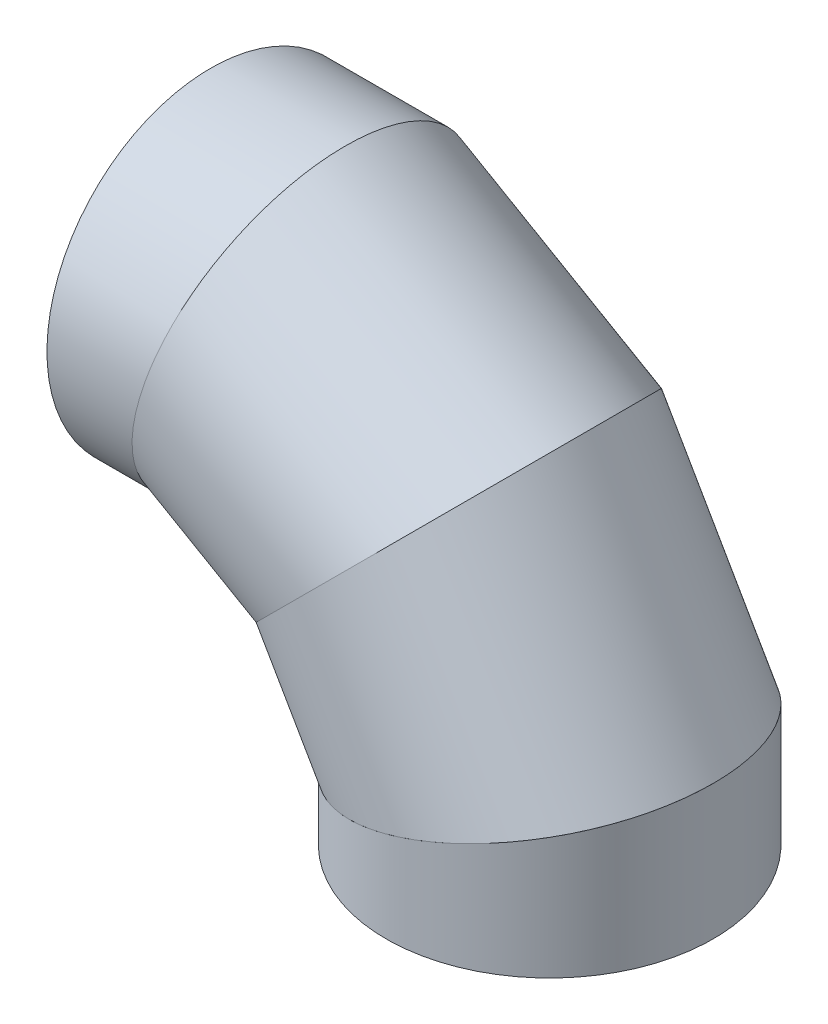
ISO-10303-21;
HEADER;
FILE_DESCRIPTION(('STEP AP214'),'2;1');
FILE_NAME('part.step','',(''),(''),'','','');
FILE_SCHEMA(('AUTOMOTIVE_DESIGN { 1 0 10303 214 1 1 1 1 }'));
ENDSEC;
DATA;
#1=APPLICATION_CONTEXT('core data for automotive mechanical design processes');
#2=APPLICATION_PROTOCOL_DEFINITION('international standard','automotive_design',2000,#1);
#3=PRODUCT_CONTEXT('',#1,'mechanical');
#4=PRODUCT('Part','Part','',(#3));
#5=PRODUCT_RELATED_PRODUCT_CATEGORY('part','',(#4));
#6=PRODUCT_DEFINITION_FORMATION('','',#4);
#7=PRODUCT_DEFINITION_CONTEXT('part definition',#1,'design');
#8=PRODUCT_DEFINITION('design','',#6,#7);
#9=PRODUCT_DEFINITION_SHAPE('','',#8);
#10=(LENGTH_UNIT() NAMED_UNIT(*) SI_UNIT(.MILLI.,.METRE.));
#11=(NAMED_UNIT(*) PLANE_ANGLE_UNIT() SI_UNIT($,.RADIAN.));
#12=(NAMED_UNIT(*) SI_UNIT($,.STERADIAN.) SOLID_ANGLE_UNIT());
#13=UNCERTAINTY_MEASURE_WITH_UNIT(LENGTH_MEASURE(1.E-05),#10,'distance_accuracy_value','');
#14=(GEOMETRIC_REPRESENTATION_CONTEXT(3) GLOBAL_UNCERTAINTY_ASSIGNED_CONTEXT((#13)) GLOBAL_UNIT_ASSIGNED_CONTEXT((#10,
#11,#12)) REPRESENTATION_CONTEXT('',''));
#15=CARTESIAN_POINT('',(0.,0.,0.));
#16=DIRECTION('',(0.,0.,1.));
#17=DIRECTION('',(1.,0.,0.));
#18=AXIS2_PLACEMENT_3D('',#15,#16,#17);
#19=CARTESIAN_POINT('',(132.61598246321,904.929584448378,0.));
#20=DIRECTION('',(0.866025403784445,-0.499999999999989,0.));
#21=DIRECTION('',(0.499999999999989,0.866025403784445,0.));
#22=AXIS2_PLACEMENT_3D('',#19,#20,#21);
#23=CYLINDRICAL_SURFACE('',#22,410.);
#24=CARTESIAN_POINT('',(227.756813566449,850.,0.));
#25=DIRECTION('',(-0.96592582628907,0.258819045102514,0.));
#26=DIRECTION('',(-0.258819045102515,-0.96592582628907,0.));
#27=AXIS2_PLACEMENT_3D('',#24,#25,#26);
#28=ELLIPSE('',#27,424.463233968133,410.);
#29=CARTESIAN_POINT('',(117.897726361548,440.000304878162,0.5));
#30=VERTEX_POINT('',#29);
#31=CARTESIAN_POINT('',(117.897726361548,440.000304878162,-0.5));
#32=VERTEX_POINT('',#31);
#33=EDGE_CURVE('E91',#30,#32,#28,.T.);
#34=ORIENTED_EDGE('',*,*,#33,.F.);
#35=DIRECTION('',(0.866025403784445,-0.499999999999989,0.));
#36=VECTOR('',#35,1.);
#37=CARTESIAN_POINT('',(-72.3838650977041,549.859432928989,0.5));
#38=LINE('',#37,#36);
#39=CARTESIAN_POINT('',(322.102578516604,322.102578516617,0.5));
#40=VERTEX_POINT('',#39);
#41=EDGE_CURVE('E105',#30,#40,#38,.T.);
#42=ORIENTED_EDGE('',*,*,#41,.T.);
#43=CARTESIAN_POINT('',(622.243186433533,622.243186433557,0.));
#44=DIRECTION('',(0.707106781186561,-0.707106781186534,0.));
#45=DIRECTION('',(0.707106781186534,0.707106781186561,0.));
#46=AXIS2_PLACEMENT_3D('',#43,#44,#45);
#47=ELLIPSE('',#46,424.463233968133,410.);
#48=CARTESIAN_POINT('',(322.102578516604,322.102578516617,-0.5));
#49=VERTEX_POINT('',#48);
#50=EDGE_CURVE('E100',#49,#40,#47,.T.);
#51=ORIENTED_EDGE('',*,*,#50,.F.);
#52=DIRECTION('',(0.866025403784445,-0.499999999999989,0.));
#53=VECTOR('',#52,1.);
#54=CARTESIAN_POINT('',(-72.3838650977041,549.859432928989,-0.5));
#55=LINE('',#54,#53);
#56=EDGE_CURVE('E114',#32,#49,#55,.T.);
#57=ORIENTED_EDGE('',*,*,#56,.F.);
#58=EDGE_LOOP('',(#34,#42,#51,#57));
#59=FACE_BOUND('',#58,.T.);
#60=ADVANCED_FACE('F47',(#59),#23,.T.);
#61=CARTESIAN_POINT('',(0.,0.,-410.));
#62=DIRECTION('',(0.707106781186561,-0.707106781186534,0.));
#63=DIRECTION('',(0.707106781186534,0.707106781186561,0.));
#64=AXIS2_PLACEMENT_3D('',#61,#62,#63);
#65=PLANE('',#64);
#66=DIRECTION('',(-0.707106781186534,-0.707106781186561,0.));
#67=VECTOR('',#66,1.);
#68=CARTESIAN_POINT('',(0.,0.,0.5));
#69=LINE('',#68,#67);
#70=CARTESIAN_POINT('',(322.834629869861,322.834629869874,0.5));
#71=VERTEX_POINT('',#70);
#72=EDGE_CURVE('E111',#71,#40,#69,.T.);
#73=ORIENTED_EDGE('',*,*,#72,.F.);
#74=CARTESIAN_POINT('',(622.243186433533,622.243186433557,0.));
#75=DIRECTION('',(0.707106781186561,-0.707106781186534,0.));
#76=DIRECTION('',(0.707106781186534,0.707106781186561,0.));
#77=AXIS2_PLACEMENT_3D('',#74,#75,#76);
#78=ELLIPSE('',#77,423.427957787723,409.);
#79=CARTESIAN_POINT('',(322.834629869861,322.834629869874,-0.5));
#80=VERTEX_POINT('',#79);
#81=EDGE_CURVE('E101',#80,#71,#78,.T.);
#82=ORIENTED_EDGE('',*,*,#81,.F.);
#83=DIRECTION('',(-0.707106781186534,-0.707106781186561,0.));
#84=VECTOR('',#83,1.);
#85=CARTESIAN_POINT('',(0.,0.,-0.5));
#86=LINE('',#85,#84);
#87=EDGE_CURVE('E68',#80,#49,#86,.T.);
#88=ORIENTED_EDGE('',*,*,#87,.T.);
#89=ORIENTED_EDGE('',*,*,#50,.T.);
#90=EDGE_LOOP('',(#73,#82,#88,#89));
#91=FACE_BOUND('',#90,.T.);
#92=ADVANCED_FACE('F119',(#91),#65,.T.);
#93=CARTESIAN_POINT('',(337.615982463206,1260.,-410.));
#94=DIRECTION('',(-0.96592582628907,0.258819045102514,0.));
#95=DIRECTION('',(-0.258819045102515,-0.96592582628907,0.));
#96=AXIS2_PLACEMENT_3D('',#93,#94,#95);
#97=PLANE('',#96);
#98=DIRECTION('',(0.258819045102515,0.96592582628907,0.));
#99=VECTOR('',#98,1.);
#100=CARTESIAN_POINT('',(337.615982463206,1260.,0.5));
#101=LINE('',#100,#99);
#102=CARTESIAN_POINT('',(118.165675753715,441.000305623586,0.5));
#103=VERTEX_POINT('',#102);
#104=EDGE_CURVE('E60',#30,#103,#101,.T.);
#105=ORIENTED_EDGE('',*,*,#104,.F.);
#106=ORIENTED_EDGE('',*,*,#33,.T.);
#107=DIRECTION('',(0.258819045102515,0.96592582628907,0.));
#108=VECTOR('',#107,1.);
#109=CARTESIAN_POINT('',(337.615982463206,1260.,-0.5));
#110=LINE('',#109,#108);
#111=CARTESIAN_POINT('',(118.165675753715,441.000305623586,-0.5));
#112=VERTEX_POINT('',#111);
#113=EDGE_CURVE('E85',#32,#112,#110,.T.);
#114=ORIENTED_EDGE('',*,*,#113,.T.);
#115=CARTESIAN_POINT('',(227.756813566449,850.,0.));
#116=DIRECTION('',(-0.96592582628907,0.258819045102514,0.));
#117=DIRECTION('',(-0.258819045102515,-0.96592582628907,0.));
#118=AXIS2_PLACEMENT_3D('',#115,#116,#117);
#119=ELLIPSE('',#118,423.427957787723,409.);
#120=EDGE_CURVE('E96',#103,#112,#119,.T.);
#121=ORIENTED_EDGE('',*,*,#120,.F.);
#122=EDGE_LOOP('',(#105,#106,#114,#121));
#123=FACE_BOUND('',#122,.T.);
#124=ADVANCED_FACE('F95',(#123),#97,.T.);
#125=CARTESIAN_POINT('',(132.61598246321,904.929584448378,0.));
#126=DIRECTION('',(0.866025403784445,-0.499999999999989,0.));
#127=DIRECTION('',(0.499999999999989,0.866025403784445,0.));
#128=AXIS2_PLACEMENT_3D('',#125,#126,#127);
#129=CYLINDRICAL_SURFACE('',#128,409.);
#130=DIRECTION('',(0.866025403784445,-0.499999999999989,0.));
#131=VECTOR('',#130,1.);
#132=CARTESIAN_POINT('',(-71.8838647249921,550.72545897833,0.5));
#133=LINE('',#132,#131);
#134=EDGE_CURVE('E13',#103,#71,#133,.T.);
#135=ORIENTED_EDGE('',*,*,#134,.F.);
#136=ORIENTED_EDGE('',*,*,#120,.T.);
#137=DIRECTION('',(0.866025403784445,-0.499999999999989,0.));
#138=VECTOR('',#137,1.);
#139=CARTESIAN_POINT('',(-71.8838647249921,550.72545897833,-0.5));
#140=LINE('',#139,#138);
#141=EDGE_CURVE('E54',#112,#80,#140,.T.);
#142=ORIENTED_EDGE('',*,*,#141,.T.);
#143=ORIENTED_EDGE('',*,*,#81,.T.);
#144=EDGE_LOOP('',(#135,#136,#142,#143));
#145=FACE_BOUND('',#144,.T.);
#146=ADVANCED_FACE('F99',(#145),#129,.F.);
#147=CARTESIAN_POINT('',(197.243186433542,-113.878406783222,-0.5));
#148=DIRECTION('',(0.,0.,1.));
#149=DIRECTION('',(1.,0.,0.));
#150=AXIS2_PLACEMENT_3D('',#147,#148,#149);
#151=PLANE('',#150);
#152=ORIENTED_EDGE('',*,*,#56,.T.);
#153=ORIENTED_EDGE('',*,*,#87,.F.);
#154=ORIENTED_EDGE('',*,*,#141,.F.);
#155=ORIENTED_EDGE('',*,*,#113,.F.);
#156=EDGE_LOOP('',(#152,#153,#154,#155));
#157=FACE_BOUND('',#156,.T.);
#158=ADVANCED_FACE('F84',(#157),#151,.T.);
#159=CARTESIAN_POINT('',(197.243186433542,-113.878406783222,0.5));
#160=DIRECTION('',(0.,0.,1.));
#161=DIRECTION('',(1.,0.,0.));
#162=AXIS2_PLACEMENT_3D('',#159,#160,#161);
#163=PLANE('',#162);
#164=ORIENTED_EDGE('',*,*,#104,.T.);
#165=ORIENTED_EDGE('',*,*,#134,.T.);
#166=ORIENTED_EDGE('',*,*,#72,.T.);
#167=ORIENTED_EDGE('',*,*,#41,.F.);
#168=EDGE_LOOP('',(#164,#165,#166,#167));
#169=FACE_BOUND('',#168,.T.);
#170=ADVANCED_FACE('F121',(#169),#163,.F.);
#171=CLOSED_SHELL('',(#60,#92,#124,#146,#158,#170));
#172=MANIFOLD_SOLID_BREP('B2',#171);
#173=CARTESIAN_POINT('',(904.929584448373,132.615982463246,0.));
#174=DIRECTION('',(-0.500000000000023,0.866025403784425,0.));
#175=DIRECTION('',(-0.866025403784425,-0.500000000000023,0.));
#176=AXIS2_PLACEMENT_3D('',#173,#174,#175);
#177=CYLINDRICAL_SURFACE('',#176,410.);
#178=CARTESIAN_POINT('',(849.999999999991,227.756813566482,0.));
#179=DIRECTION('',(0.258819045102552,-0.96592582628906,0.));
#180=DIRECTION('',(-0.96592582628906,-0.258819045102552,0.));
#181=AXIS2_PLACEMENT_3D('',#178,#179,#180);
#182=ELLIPSE('',#181,424.463233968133,410.);
#183=CARTESIAN_POINT('',(440.000304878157,117.897726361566,-0.5));
#184=VERTEX_POINT('',#183);
#185=CARTESIAN_POINT('',(440.000304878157,117.897726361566,0.5));
#186=VERTEX_POINT('',#185);
#187=EDGE_CURVE('E224',#184,#186,#182,.T.);
#188=ORIENTED_EDGE('',*,*,#187,.F.);
#189=DIRECTION('',(-0.500000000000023,0.866025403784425,0.));
#190=VECTOR('',#189,1.);
#191=CARTESIAN_POINT('',(549.859432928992,-72.3838650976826,-0.5));
#192=LINE('',#191,#190);
#193=CARTESIAN_POINT('',(322.102578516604,322.102578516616,-0.500000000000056));
#194=VERTEX_POINT('',#193);
#195=EDGE_CURVE('E239',#184,#194,#192,.T.);
#196=ORIENTED_EDGE('',*,*,#195,.T.);
#197=CARTESIAN_POINT('',(622.243186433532,622.243186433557,0.));
#198=DIRECTION('',(-0.707106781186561,0.707106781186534,0.));
#199=DIRECTION('',(0.707106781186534,0.707106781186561,0.));
#200=AXIS2_PLACEMENT_3D('',#197,#198,#199);
#201=ELLIPSE('',#200,424.463233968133,410.);
#202=CARTESIAN_POINT('',(322.102578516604,322.102578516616,0.499999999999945));
#203=VERTEX_POINT('',#202);
#204=EDGE_CURVE('E234',#203,#194,#201,.T.);
#205=ORIENTED_EDGE('',*,*,#204,.F.);
#206=DIRECTION('',(-0.500000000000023,0.866025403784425,0.));
#207=VECTOR('',#206,1.);
#208=CARTESIAN_POINT('',(549.859432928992,-72.3838650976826,0.5));
#209=LINE('',#208,#207);
#210=EDGE_CURVE('E231',#186,#203,#209,.T.);
#211=ORIENTED_EDGE('',*,*,#210,.F.);
#212=EDGE_LOOP('',(#188,#196,#205,#211));
#213=FACE_BOUND('',#212,.T.);
#214=ADVANCED_FACE('F180',(#213),#177,.T.);
#215=CARTESIAN_POINT('',(0.,0.,-410.));
#216=DIRECTION('',(0.258819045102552,-0.96592582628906,0.));
#217=DIRECTION('',(0.96592582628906,0.258819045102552,0.));
#218=AXIS2_PLACEMENT_3D('',#215,#216,#217);
#219=PLANE('',#218);
#220=DIRECTION('',(0.96592582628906,0.258819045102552,0.));
#221=VECTOR('',#220,1.);
#222=CARTESIAN_POINT('',(0.,0.,-0.5));
#223=LINE('',#222,#221);
#224=CARTESIAN_POINT('',(441.000305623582,118.165675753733,-0.5));
#225=VERTEX_POINT('',#224);
#226=EDGE_CURVE('E193',#184,#225,#223,.T.);
#227=ORIENTED_EDGE('',*,*,#226,.F.);
#228=ORIENTED_EDGE('',*,*,#187,.T.);
#229=DIRECTION('',(0.96592582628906,0.258819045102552,0.));
#230=VECTOR('',#229,1.);
#231=CARTESIAN_POINT('',(0.,0.,0.5));
#232=LINE('',#231,#230);
#233=CARTESIAN_POINT('',(441.000305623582,118.165675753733,0.5));
#234=VERTEX_POINT('',#233);
#235=EDGE_CURVE('E218',#186,#234,#232,.T.);
#236=ORIENTED_EDGE('',*,*,#235,.T.);
#237=CARTESIAN_POINT('',(849.999999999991,227.756813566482,0.));
#238=DIRECTION('',(0.258819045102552,-0.96592582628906,0.));
#239=DIRECTION('',(-0.96592582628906,-0.258819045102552,0.));
#240=AXIS2_PLACEMENT_3D('',#237,#238,#239);
#241=ELLIPSE('',#240,423.427957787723,409.);
#242=EDGE_CURVE('E229',#225,#234,#241,.T.);
#243=ORIENTED_EDGE('',*,*,#242,.F.);
#244=EDGE_LOOP('',(#227,#228,#236,#243));
#245=FACE_BOUND('',#244,.T.);
#246=ADVANCED_FACE('F228',(#245),#219,.T.);
#247=CARTESIAN_POINT('',(922.384017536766,922.384017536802,-410.));
#248=DIRECTION('',(-0.707106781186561,0.707106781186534,0.));
#249=DIRECTION('',(-0.707106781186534,-0.707106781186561,0.));
#250=AXIS2_PLACEMENT_3D('',#247,#248,#249);
#251=PLANE('',#250);
#252=DIRECTION('',(-0.707106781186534,-0.707106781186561,0.));
#253=VECTOR('',#252,1.);
#254=CARTESIAN_POINT('',(922.384017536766,922.384017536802,-0.500000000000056));
#255=LINE('',#254,#253);
#256=CARTESIAN_POINT('',(322.834629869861,322.834629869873,-0.5));
#257=VERTEX_POINT('',#256);
#258=EDGE_CURVE('E246',#257,#194,#255,.T.);
#259=ORIENTED_EDGE('',*,*,#258,.F.);
#260=CARTESIAN_POINT('',(622.243186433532,622.243186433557,0.));
#261=DIRECTION('',(-0.707106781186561,0.707106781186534,0.));
#262=DIRECTION('',(0.707106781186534,0.707106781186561,0.));
#263=AXIS2_PLACEMENT_3D('',#260,#261,#262);
#264=ELLIPSE('',#263,423.427957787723,409.);
#265=CARTESIAN_POINT('',(322.834629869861,322.834629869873,0.5));
#266=VERTEX_POINT('',#265);
#267=EDGE_CURVE('E235',#266,#257,#264,.T.);
#268=ORIENTED_EDGE('',*,*,#267,.F.);
#269=DIRECTION('',(-0.707106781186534,-0.707106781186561,0.));
#270=VECTOR('',#269,1.);
#271=CARTESIAN_POINT('',(922.384017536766,922.384017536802,0.499999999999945));
#272=LINE('',#271,#270);
#273=EDGE_CURVE('E201',#266,#203,#272,.T.);
#274=ORIENTED_EDGE('',*,*,#273,.T.);
#275=ORIENTED_EDGE('',*,*,#204,.T.);
#276=EDGE_LOOP('',(#259,#268,#274,#275));
#277=FACE_BOUND('',#276,.T.);
#278=ADVANCED_FACE('F252',(#277),#251,.T.);
#279=CARTESIAN_POINT('',(904.929584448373,132.615982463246,0.));
#280=DIRECTION('',(-0.500000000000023,0.866025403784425,0.));
#281=DIRECTION('',(-0.866025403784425,-0.500000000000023,0.));
#282=AXIS2_PLACEMENT_3D('',#279,#280,#281);
#283=CYLINDRICAL_SURFACE('',#282,409.);
#284=DIRECTION('',(-0.500000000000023,0.866025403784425,0.));
#285=VECTOR('',#284,1.);
#286=CARTESIAN_POINT('',(550.725458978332,-71.8838647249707,-0.5));
#287=LINE('',#286,#285);
#288=EDGE_CURVE('E45',#225,#257,#287,.T.);
#289=ORIENTED_EDGE('',*,*,#288,.F.);
#290=ORIENTED_EDGE('',*,*,#242,.T.);
#291=DIRECTION('',(-0.500000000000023,0.866025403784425,0.));
#292=VECTOR('',#291,1.);
#293=CARTESIAN_POINT('',(550.725458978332,-71.8838647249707,0.5));
#294=LINE('',#293,#292);
#295=EDGE_CURVE('E187',#234,#266,#294,.T.);
#296=ORIENTED_EDGE('',*,*,#295,.T.);
#297=ORIENTED_EDGE('',*,*,#267,.T.);
#298=EDGE_LOOP('',(#289,#290,#296,#297));
#299=FACE_BOUND('',#298,.T.);
#300=ADVANCED_FACE('F233',(#299),#283,.F.);
#301=CARTESIAN_POINT('',(-113.878406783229,197.243186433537,0.5));
#302=DIRECTION('',(0.,0.,-1.));
#303=DIRECTION('',(-1.,0.,0.));
#304=AXIS2_PLACEMENT_3D('',#301,#302,#303);
#305=PLANE('',#304);
#306=ORIENTED_EDGE('',*,*,#210,.T.);
#307=ORIENTED_EDGE('',*,*,#273,.F.);
#308=ORIENTED_EDGE('',*,*,#295,.F.);
#309=ORIENTED_EDGE('',*,*,#235,.F.);
#310=EDGE_LOOP('',(#306,#307,#308,#309));
#311=FACE_BOUND('',#310,.T.);
#312=ADVANCED_FACE('F217',(#311),#305,.T.);
#313=CARTESIAN_POINT('',(-113.878406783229,197.243186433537,-0.5));
#314=DIRECTION('',(0.,0.,-1.));
#315=DIRECTION('',(-1.,0.,0.));
#316=AXIS2_PLACEMENT_3D('',#313,#314,#315);
#317=PLANE('',#316);
#318=ORIENTED_EDGE('',*,*,#226,.T.);
#319=ORIENTED_EDGE('',*,*,#288,.T.);
#320=ORIENTED_EDGE('',*,*,#258,.T.);
#321=ORIENTED_EDGE('',*,*,#195,.F.);
#322=EDGE_LOOP('',(#318,#319,#320,#321));
#323=FACE_BOUND('',#322,.T.);
#324=ADVANCED_FACE('F254',(#323),#317,.F.);
#325=CLOSED_SHELL('',(#214,#246,#278,#300,#312,#324));
#326=MANIFOLD_SOLID_BREP('B7',#325);
#327=CARTESIAN_POINT('',(849.99999999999,337.615982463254,0.));
#328=DIRECTION('',(0.,-1.,0.));
#329=DIRECTION('',(1.,0.,0.));
#330=AXIS2_PLACEMENT_3D('',#327,#328,#329);
#331=CYLINDRICAL_SURFACE('',#330,409.999999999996);
#332=DIRECTION('',(0.,-1.,0.));
#333=VECTOR('',#332,1.);
#334=CARTESIAN_POINT('',(440.000304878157,337.615982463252,0.5));
#335=LINE('',#334,#333);
#336=CARTESIAN_POINT('',(440.000304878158,1.64402184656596E-12,0.5));
#337=VERTEX_POINT('',#336);
#338=CARTESIAN_POINT('',(440.000304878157,117.897726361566,0.500000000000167));
#339=VERTEX_POINT('',#338);
#340=EDGE_CURVE('E352',#337,#339,#335,.F.);
#341=ORIENTED_EDGE('',*,*,#340,.F.);
#342=CARTESIAN_POINT('',(849.999999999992,3.17594909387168E-12,0.));
#343=DIRECTION('',(0.,1.,0.));
#344=DIRECTION('',(-1.,0.,0.));
#345=AXIS2_PLACEMENT_3D('',#342,#343,#344);
#346=CIRCLE('',#345,409.999999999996);
#347=CARTESIAN_POINT('',(440.000304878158,1.64402184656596E-12,-0.5));
#348=VERTEX_POINT('',#347);
#349=EDGE_CURVE('E362',#337,#348,#346,.T.);
#350=ORIENTED_EDGE('',*,*,#349,.T.);
#351=DIRECTION('',(0.,-1.,0.));
#352=VECTOR('',#351,1.);
#353=CARTESIAN_POINT('',(440.000304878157,337.615982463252,-0.5));
#354=LINE('',#353,#352);
#355=CARTESIAN_POINT('',(440.000304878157,117.897726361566,-0.500000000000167));
#356=VERTEX_POINT('',#355);
#357=EDGE_CURVE('E380',#348,#356,#354,.F.);
#358=ORIENTED_EDGE('',*,*,#357,.T.);
#359=CARTESIAN_POINT('',(849.999999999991,227.756813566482,0.));
#360=DIRECTION('',(-0.258819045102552,0.96592582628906,0.));
#361=DIRECTION('',(-0.96592582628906,-0.258819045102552,0.));
#362=AXIS2_PLACEMENT_3D('',#359,#360,#361);
#363=ELLIPSE('',#362,424.463233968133,409.999999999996);
#364=EDGE_CURVE('E364',#339,#356,#363,.T.);
#365=ORIENTED_EDGE('',*,*,#364,.F.);
#366=EDGE_LOOP('',(#341,#350,#358,#365));
#367=FACE_BOUND('',#366,.T.);
#368=ADVANCED_FACE('F312',(#367),#331,.T.);
#369=CARTESIAN_POINT('',(849.999999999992,3.17594909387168E-12,0.));
#370=DIRECTION('',(0.,1.,0.));
#371=DIRECTION('',(-1.,0.,0.));
#372=AXIS2_PLACEMENT_3D('',#369,#370,#371);
#373=PLANE('',#372);
#374=DIRECTION('',(-1.,0.,0.));
#375=VECTOR('',#374,1.);
#376=CARTESIAN_POINT('',(0.,0.,0.5));
#377=LINE('',#376,#375);
#378=CARTESIAN_POINT('',(441.000305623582,1.63594478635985E-12,0.5));
#379=VERTEX_POINT('',#378);
#380=EDGE_CURVE('E349',#337,#379,#377,.F.);
#381=ORIENTED_EDGE('',*,*,#380,.T.);
#382=CARTESIAN_POINT('',(849.999999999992,3.1641356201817E-12,0.));
#383=DIRECTION('',(0.,1.,0.));
#384=DIRECTION('',(-1.,0.,0.));
#385=AXIS2_PLACEMENT_3D('',#382,#383,#384);
#386=CIRCLE('',#385,408.999999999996);
#387=CARTESIAN_POINT('',(441.000305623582,1.63594478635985E-12,-0.5));
#388=VERTEX_POINT('',#387);
#389=EDGE_CURVE('E365',#379,#388,#386,.T.);
#390=ORIENTED_EDGE('',*,*,#389,.T.);
#391=DIRECTION('',(-1.,0.,0.));
#392=VECTOR('',#391,1.);
#393=CARTESIAN_POINT('',(0.,0.,-0.5));
#394=LINE('',#393,#392);
#395=EDGE_CURVE('E333',#348,#388,#394,.F.);
#396=ORIENTED_EDGE('',*,*,#395,.F.);
#397=ORIENTED_EDGE('',*,*,#349,.F.);
#398=EDGE_LOOP('',(#381,#390,#396,#397));
#399=FACE_BOUND('',#398,.T.);
#400=ADVANCED_FACE('F367',(#399),#373,.F.);
#401=CARTESIAN_POINT('',(0.,0.,2451.91251883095));
#402=DIRECTION('',(-0.258819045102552,0.96592582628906,0.));
#403=DIRECTION('',(-0.96592582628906,-0.258819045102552,0.));
#404=AXIS2_PLACEMENT_3D('',#401,#402,#403);
#405=PLANE('',#404);
#406=CARTESIAN_POINT('',(849.999999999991,227.756813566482,0.));
#407=DIRECTION('',(-0.258819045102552,0.96592582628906,0.));
#408=DIRECTION('',(-0.96592582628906,-0.258819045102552,0.));
#409=AXIS2_PLACEMENT_3D('',#406,#407,#408);
#410=ELLIPSE('',#409,423.427957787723,408.999999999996);
#411=CARTESIAN_POINT('',(441.000305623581,118.165675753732,0.5));
#412=VERTEX_POINT('',#411);
#413=CARTESIAN_POINT('',(441.000305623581,118.165675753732,-0.5));
#414=VERTEX_POINT('',#413);
#415=EDGE_CURVE('E368',#412,#414,#410,.T.);
#416=ORIENTED_EDGE('',*,*,#415,.F.);
#417=DIRECTION('',(-0.96592582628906,-0.258819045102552,0.));
#418=VECTOR('',#417,1.);
#419=CARTESIAN_POINT('',(0.,0.,0.500000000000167));
#420=LINE('',#419,#418);
#421=EDGE_CURVE('E326',#412,#339,#420,.T.);
#422=ORIENTED_EDGE('',*,*,#421,.T.);
#423=ORIENTED_EDGE('',*,*,#364,.T.);
#424=DIRECTION('',(-0.96592582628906,-0.258819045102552,0.));
#425=VECTOR('',#424,1.);
#426=CARTESIAN_POINT('',(0.,0.,-0.500000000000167));
#427=LINE('',#426,#425);
#428=EDGE_CURVE('E375',#414,#356,#427,.T.);
#429=ORIENTED_EDGE('',*,*,#428,.F.);
#430=EDGE_LOOP('',(#416,#422,#423,#429));
#431=FACE_BOUND('',#430,.T.);
#432=ADVANCED_FACE('F379',(#431),#405,.T.);
#433=CARTESIAN_POINT('',(849.99999999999,337.615982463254,0.));
#434=DIRECTION('',(0.,-1.,0.));
#435=DIRECTION('',(1.,0.,0.));
#436=AXIS2_PLACEMENT_3D('',#433,#434,#435);
#437=CYLINDRICAL_SURFACE('',#436,408.999999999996);
#438=ORIENTED_EDGE('',*,*,#389,.F.);
#439=DIRECTION('',(0.,-1.,0.));
#440=VECTOR('',#439,1.);
#441=CARTESIAN_POINT('',(441.000305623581,337.615982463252,0.5));
#442=LINE('',#441,#440);
#443=EDGE_CURVE('E178',#379,#412,#442,.F.);
#444=ORIENTED_EDGE('',*,*,#443,.T.);
#445=ORIENTED_EDGE('',*,*,#415,.T.);
#446=DIRECTION('',(0.,-1.,0.));
#447=VECTOR('',#446,1.);
#448=CARTESIAN_POINT('',(441.000305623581,337.615982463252,-0.5));
#449=LINE('',#448,#447);
#450=EDGE_CURVE('E319',#388,#414,#449,.F.);
#451=ORIENTED_EDGE('',*,*,#450,.F.);
#452=EDGE_LOOP('',(#438,#444,#445,#451));
#453=FACE_BOUND('',#452,.T.);
#454=ADVANCED_FACE('F382',(#453),#437,.F.);
#455=CARTESIAN_POINT('',(-8.50992994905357E-13,227.756813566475,-0.5));
#456=DIRECTION('',(0.,0.,-1.));
#457=DIRECTION('',(-1.,0.,0.));
#458=AXIS2_PLACEMENT_3D('',#455,#456,#457);
#459=PLANE('',#458);
#460=ORIENTED_EDGE('',*,*,#395,.T.);
#461=ORIENTED_EDGE('',*,*,#450,.T.);
#462=ORIENTED_EDGE('',*,*,#428,.T.);
#463=ORIENTED_EDGE('',*,*,#357,.F.);
#464=EDGE_LOOP('',(#460,#461,#462,#463));
#465=FACE_BOUND('',#464,.T.);
#466=ADVANCED_FACE('F374',(#465),#459,.F.);
#467=CARTESIAN_POINT('',(-8.50992994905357E-13,227.756813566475,0.5));
#468=DIRECTION('',(0.,0.,-1.));
#469=DIRECTION('',(-1.,0.,0.));
#470=AXIS2_PLACEMENT_3D('',#467,#468,#469);
#471=PLANE('',#470);
#472=ORIENTED_EDGE('',*,*,#340,.T.);
#473=ORIENTED_EDGE('',*,*,#421,.F.);
#474=ORIENTED_EDGE('',*,*,#443,.F.);
#475=ORIENTED_EDGE('',*,*,#380,.F.);
#476=EDGE_LOOP('',(#472,#473,#474,#475));
#477=FACE_BOUND('',#476,.T.);
#478=ADVANCED_FACE('F351',(#477),#471,.T.);
#479=CLOSED_SHELL('',(#368,#400,#432,#454,#466,#478));
#480=MANIFOLD_SOLID_BREP('B39',#479);
#481=CARTESIAN_POINT('',(0.,0.,2022.25192064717));
#482=DIRECTION('',(-0.96592582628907,0.258819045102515,0.));
#483=DIRECTION('',(-0.258819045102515,-0.96592582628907,0.));
#484=AXIS2_PLACEMENT_3D('',#481,#482,#483);
#485=PLANE('',#484);
#486=DIRECTION('',(-0.258819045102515,-0.96592582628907,0.));
#487=VECTOR('',#486,1.);
#488=CARTESIAN_POINT('',(0.,0.,0.500000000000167));
#489=LINE('',#488,#487);
#490=CARTESIAN_POINT('',(118.165675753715,441.000305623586,0.5));
#491=VERTEX_POINT('',#490);
#492=CARTESIAN_POINT('',(117.897726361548,440.000304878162,0.500000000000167));
#493=VERTEX_POINT('',#492);
#494=EDGE_CURVE('E476',#491,#493,#489,.T.);
#495=ORIENTED_EDGE('',*,*,#494,.F.);
#496=CARTESIAN_POINT('',(227.756813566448,850.,0.));
#497=DIRECTION('',(-0.96592582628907,0.258819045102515,0.));
#498=DIRECTION('',(-0.258819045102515,-0.96592582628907,0.));
#499=AXIS2_PLACEMENT_3D('',#496,#497,#498);
#500=ELLIPSE('',#499,423.427957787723,409.);
#501=CARTESIAN_POINT('',(118.165675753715,441.000305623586,-0.5));
#502=VERTEX_POINT('',#501);
#503=EDGE_CURVE('E481',#491,#502,#500,.T.);
#504=ORIENTED_EDGE('',*,*,#503,.T.);
#505=DIRECTION('',(-0.258819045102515,-0.96592582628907,0.));
#506=VECTOR('',#505,1.);
#507=CARTESIAN_POINT('',(0.,0.,-0.500000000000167));
#508=LINE('',#507,#506);
#509=CARTESIAN_POINT('',(117.897726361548,440.000304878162,-0.500000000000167));
#510=VERTEX_POINT('',#509);
#511=EDGE_CURVE('E457',#502,#510,#508,.T.);
#512=ORIENTED_EDGE('',*,*,#511,.T.);
#513=CARTESIAN_POINT('',(227.756813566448,850.,0.));
#514=DIRECTION('',(-0.96592582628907,0.258819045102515,0.));
#515=DIRECTION('',(-0.258819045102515,-0.96592582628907,0.));
#516=AXIS2_PLACEMENT_3D('',#513,#514,#515);
#517=ELLIPSE('',#516,424.463233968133,410.);
#518=EDGE_CURVE('E495',#493,#510,#517,.T.);
#519=ORIENTED_EDGE('',*,*,#518,.F.);
#520=EDGE_LOOP('',(#495,#504,#512,#519));
#521=FACE_BOUND('',#520,.T.);
#522=ADVANCED_FACE('F435',(#521),#485,.F.);
#523=CARTESIAN_POINT('',(337.615982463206,850.,0.));
#524=DIRECTION('',(-1.,0.,0.));
#525=DIRECTION('',(0.,0.,1.));
#526=AXIS2_PLACEMENT_3D('',#523,#524,#525);
#527=CYLINDRICAL_SURFACE('',#526,410.);
#528=DIRECTION('',(-1.,0.,0.));
#529=VECTOR('',#528,1.);
#530=CARTESIAN_POINT('',(337.615982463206,440.000304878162,0.5));
#531=LINE('',#530,#529);
#532=CARTESIAN_POINT('',(0.,440.000304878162,0.5));
#533=VERTEX_POINT('',#532);
#534=EDGE_CURVE('E473',#493,#533,#531,.T.);
#535=ORIENTED_EDGE('',*,*,#534,.F.);
#536=ORIENTED_EDGE('',*,*,#518,.T.);
#537=DIRECTION('',(-1.,0.,0.));
#538=VECTOR('',#537,1.);
#539=CARTESIAN_POINT('',(337.615982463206,440.000304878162,-0.5));
#540=LINE('',#539,#538);
#541=CARTESIAN_POINT('',(0.,440.000304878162,-0.5));
#542=VERTEX_POINT('',#541);
#543=EDGE_CURVE('E494',#510,#542,#540,.T.);
#544=ORIENTED_EDGE('',*,*,#543,.T.);
#545=CARTESIAN_POINT('',(0.,850.,0.));
#546=DIRECTION('',(1.,0.,0.));
#547=DIRECTION('',(0.,0.,-1.));
#548=AXIS2_PLACEMENT_3D('',#545,#546,#547);
#549=CIRCLE('',#548,410.);
#550=EDGE_CURVE('E488',#542,#533,#549,.T.);
#551=ORIENTED_EDGE('',*,*,#550,.T.);
#552=EDGE_LOOP('',(#535,#536,#544,#551));
#553=FACE_BOUND('',#552,.T.);
#554=ADVANCED_FACE('F437',(#553),#527,.T.);
#555=CARTESIAN_POINT('',(0.,850.,0.));
#556=DIRECTION('',(1.,0.,0.));
#557=DIRECTION('',(0.,0.,-1.));
#558=AXIS2_PLACEMENT_3D('',#555,#556,#557);
#559=PLANE('',#558);
#560=DIRECTION('',(0.,1.,0.));
#561=VECTOR('',#560,1.);
#562=CARTESIAN_POINT('',(0.,850.,0.5));
#563=LINE('',#562,#561);
#564=CARTESIAN_POINT('',(0.,441.000305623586,0.5));
#565=VERTEX_POINT('',#564);
#566=EDGE_CURVE('E450',#565,#533,#563,.F.);
#567=ORIENTED_EDGE('',*,*,#566,.T.);
#568=ORIENTED_EDGE('',*,*,#550,.F.);
#569=DIRECTION('',(0.,1.,0.));
#570=VECTOR('',#569,1.);
#571=CARTESIAN_POINT('',(0.,850.,-0.5));
#572=LINE('',#571,#570);
#573=CARTESIAN_POINT('',(0.,441.000305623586,-0.5));
#574=VERTEX_POINT('',#573);
#575=EDGE_CURVE('E491',#574,#542,#572,.F.);
#576=ORIENTED_EDGE('',*,*,#575,.F.);
#577=CARTESIAN_POINT('',(0.,850.,0.));
#578=DIRECTION('',(1.,0.,0.));
#579=DIRECTION('',(0.,0.,-1.));
#580=AXIS2_PLACEMENT_3D('',#577,#578,#579);
#581=CIRCLE('',#580,409.);
#582=EDGE_CURVE('E490',#574,#565,#581,.T.);
#583=ORIENTED_EDGE('',*,*,#582,.T.);
#584=EDGE_LOOP('',(#567,#568,#576,#583));
#585=FACE_BOUND('',#584,.T.);
#586=ADVANCED_FACE('F486',(#585),#559,.F.);
#587=CARTESIAN_POINT('',(337.615982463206,850.,0.));
#588=DIRECTION('',(-1.,0.,0.));
#589=DIRECTION('',(0.,0.,1.));
#590=AXIS2_PLACEMENT_3D('',#587,#588,#589);
#591=CYLINDRICAL_SURFACE('',#590,409.);
#592=ORIENTED_EDGE('',*,*,#503,.F.);
#593=DIRECTION('',(-1.,0.,0.));
#594=VECTOR('',#593,1.);
#595=CARTESIAN_POINT('',(337.615982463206,441.000305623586,0.5));
#596=LINE('',#595,#594);
#597=EDGE_CURVE('E310',#491,#565,#596,.T.);
#598=ORIENTED_EDGE('',*,*,#597,.T.);
#599=ORIENTED_EDGE('',*,*,#582,.F.);
#600=DIRECTION('',(-1.,0.,0.));
#601=VECTOR('',#600,1.);
#602=CARTESIAN_POINT('',(337.615982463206,441.000305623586,-0.5));
#603=LINE('',#602,#601);
#604=EDGE_CURVE('E443',#502,#574,#603,.T.);
#605=ORIENTED_EDGE('',*,*,#604,.F.);
#606=EDGE_LOOP('',(#592,#598,#599,#605));
#607=FACE_BOUND('',#606,.T.);
#608=ADVANCED_FACE('F508',(#607),#591,.F.);
#609=CARTESIAN_POINT('',(227.756813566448,850.,-0.5));
#610=DIRECTION('',(0.,0.,-1.));
#611=DIRECTION('',(-1.,0.,0.));
#612=AXIS2_PLACEMENT_3D('',#609,#610,#611);
#613=PLANE('',#612);
#614=ORIENTED_EDGE('',*,*,#511,.F.);
#615=ORIENTED_EDGE('',*,*,#604,.T.);
#616=ORIENTED_EDGE('',*,*,#575,.T.);
#617=ORIENTED_EDGE('',*,*,#543,.F.);
#618=EDGE_LOOP('',(#614,#615,#616,#617));
#619=FACE_BOUND('',#618,.T.);
#620=ADVANCED_FACE('F505',(#619),#613,.F.);
#621=CARTESIAN_POINT('',(227.756813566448,850.,0.5));
#622=DIRECTION('',(0.,0.,-1.));
#623=DIRECTION('',(-1.,0.,0.));
#624=AXIS2_PLACEMENT_3D('',#621,#622,#623);
#625=PLANE('',#624);
#626=ORIENTED_EDGE('',*,*,#534,.T.);
#627=ORIENTED_EDGE('',*,*,#566,.F.);
#628=ORIENTED_EDGE('',*,*,#597,.F.);
#629=ORIENTED_EDGE('',*,*,#494,.T.);
#630=EDGE_LOOP('',(#626,#627,#628,#629));
#631=FACE_BOUND('',#630,.T.);
#632=ADVANCED_FACE('F474',(#631),#625,.T.);
#633=CLOSED_SHELL('',(#522,#554,#586,#608,#620,#632));
#634=MANIFOLD_SOLID_BREP('B172',#633);
#635=ADVANCED_BREP_SHAPE_REPRESENTATION('',(#18,#172,#326,#480,#634),#14);
#636=SHAPE_DEFINITION_REPRESENTATION(#9,#635);
ENDSEC;
END-ISO-10303-21;
